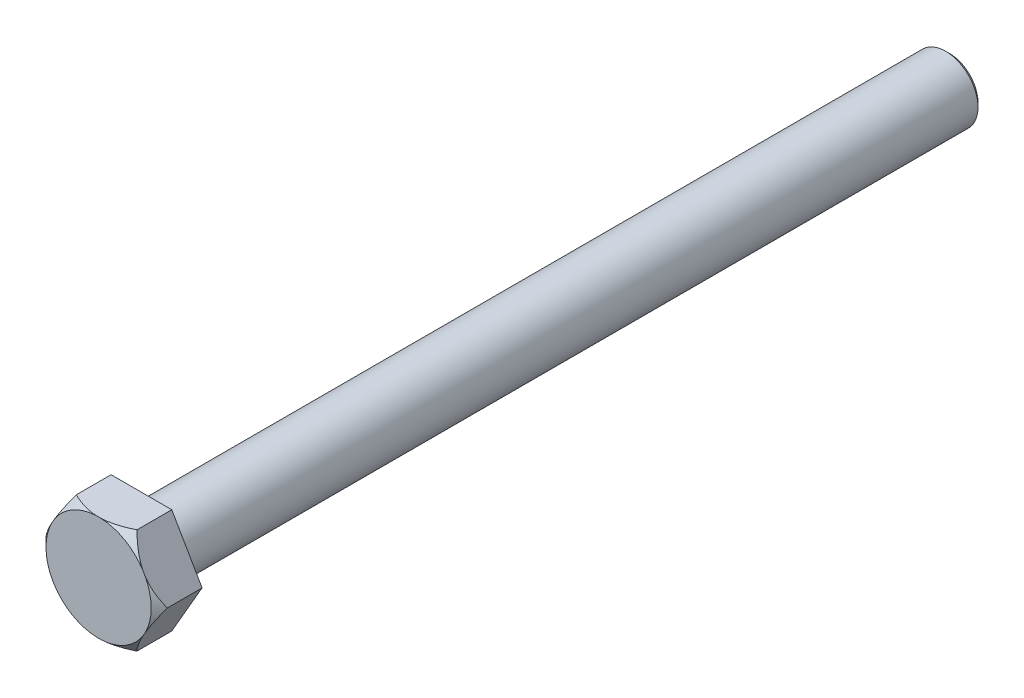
from build123d import *

# Parameters (mm, degrees)
BOSS_EXTRU_1_DEPTH = 5.3


with BuildPart() as part:
    # Esquisse1 → Boss.-Extru.1 (new body)
    with BuildSketch(Plane.XY):
        Polygon((7.505553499, 0), (3.75277675, 6.5), (-3.75277675, 6.5), (-7.505553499, 0), (-3.75277675, -6.5), (3.75277675, -6.5), align=None)
    extrude(amount=BOSS_EXTRU_1_DEPTH)

    # Esquisse3 → Enl_vement de mati_re-R_volution2 (revolve, cut)
    with BuildSketch(Plane(origin=(0, 0, 0), x_dir=(1, 0, 0), z_dir=(0, 1, 0))):
        Polygon((-7.505553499, -4.3), (-6.505553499, -5.3), (-6.505553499, -6.142860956), (-9.024896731, -6.142860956), (-9.024896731, -4.3), align=None)
    revolve(axis=Axis((0, 0, -2.903094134), (0, 0, 1)), mode=Mode.SUBTRACT)


with BuildPart() as body_2:
    # Esquisse4 → R_volution2 (revolve)
    with BuildSketch(Plane(origin=(0, 0, 0), x_dir=(0, 0, -1), z_dir=(1, 0, 0)), mode=Mode.PRIVATE) as r_volution2_sk:
        Polygon((0, -4), (99.5, -4), (100, -3.5), (100, 0), (0, 0), align=None)
    revolve(r_volution2_sk.sketch.rotate(Axis((0, 0, 0), (0, 0, -1)), 270), axis=Axis((0, 0, 0), (0, 0, -1)))


solid = Compound([part.part, body_2.part])
